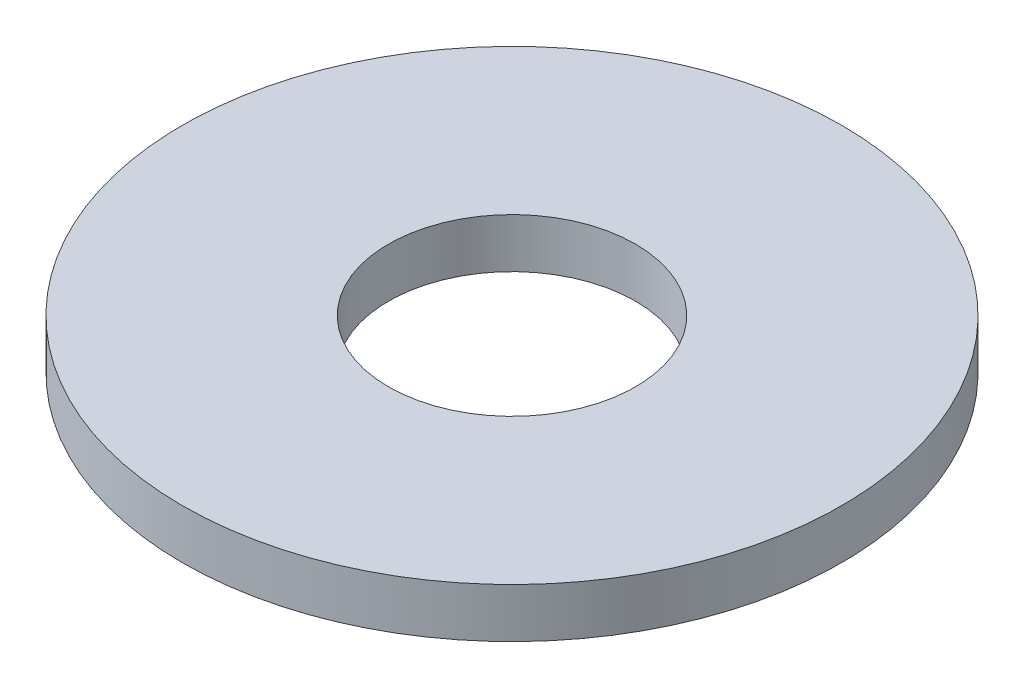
from build123d import *

# Parameters (mm, degrees)
SKETCH1_R      = 2
SKETCH1_R_2    = 0.75
EXTRUDE1_DEPTH = 0.3


with BuildPart() as part:
    # Sketch1 → Extrude1 (new body)
    with BuildSketch(Plane(origin=(0, 0, 0), x_dir=(1, 0, 0), z_dir=(0, 1, 0))):
        with Locations(Location((0, 0, 0), (0, 0, 270))):
            Circle(SKETCH1_R)
        with Locations(Location((0, 0, 0), (0, 0, 270))):
            Circle(SKETCH1_R_2, mode=Mode.SUBTRACT)
    extrude(amount=EXTRUDE1_DEPTH)


solid = part.part
